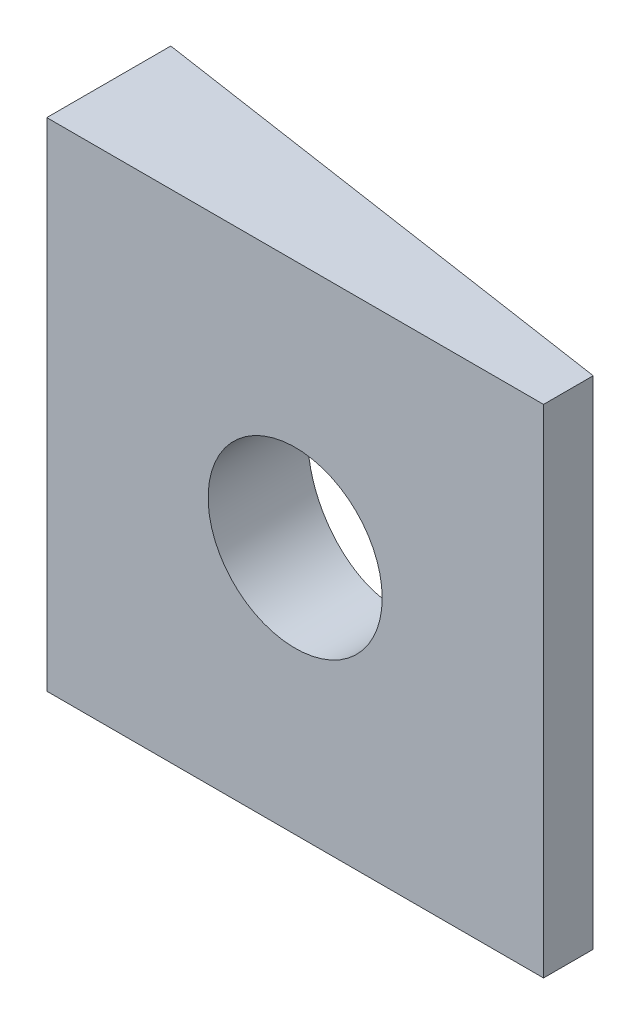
from build123d import *

# Parameters (mm, degrees)
BOSS_EXTRUDE1_DEPTH = 15.875
SKETCH2_R           = 5.5626
CUT_EXTRUDE1_DEPTH  = 24.808269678


with BuildPart() as part:
    # Sketch1 → Boss-Extrude1 (new, symmetric)
    with BuildSketch(Plane(origin=(0, 0, 0), x_dir=(1, 0, 0), z_dir=(0, 1, 0))):
        Polygon((-15.875, 0), (15.875, 0), (15.875, 3.175), (-15.875, 7.9248), align=None)
    extrude(amount=BOSS_EXTRUDE1_DEPTH, both=True)

    # Sketch2 → Cut-Extrude1 (cut, through all)
    with BuildSketch(Plane.XY):
        Circle(SKETCH2_R)
    extrude(amount=-CUT_EXTRUDE1_DEPTH, mode=Mode.SUBTRACT)


solid = part.part
